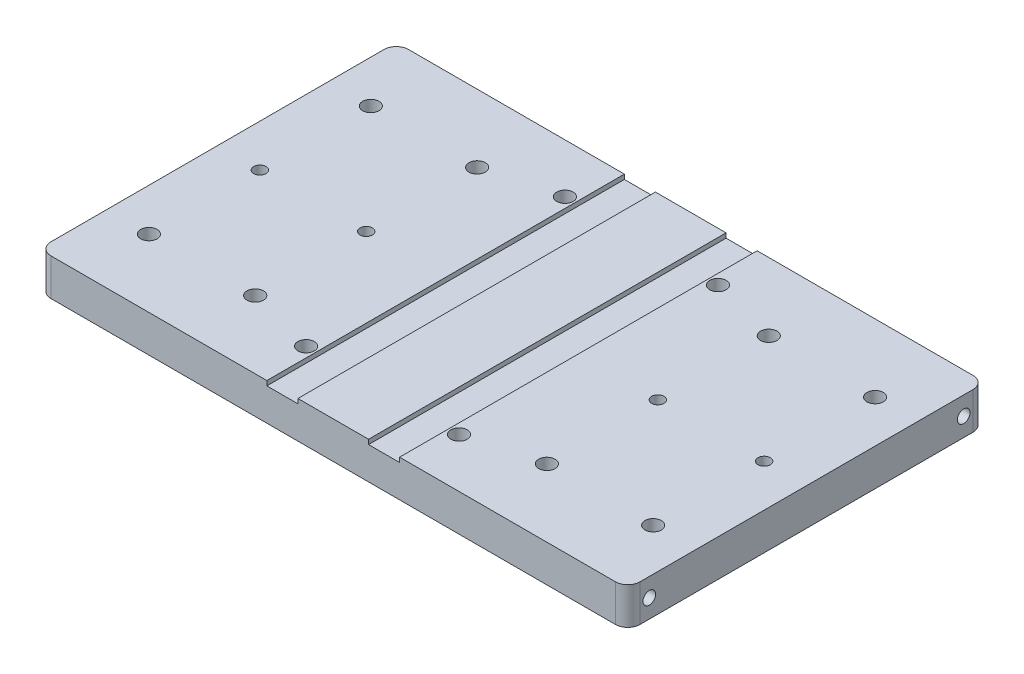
from build123d import *

# Parameters (mm, degrees)
SKETCH1_W                                         = 303.3776
SKETCH1_H                                         = 184.15
BOSS_EXTRUDE1_DEPTH                               = 9.525
SKETCH2_W                                         = 16.002
SKETCH2_H                                         = 2.38600742
CUT_EXTRUDE1_DEPTH                                = 239.770685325
CBORE_FOR_5_16_SOCKET_HEAD_CAP_SCREW1_D           = 8.4328
CBORE_FOR_5_16_SOCKET_HEAD_CAP_SCREW1_CBORE_D     = 13.49502
CBORE_FOR_5_16_SOCKET_HEAD_CAP_SCREW1_CBORE_DEPTH = 7.9375
F_5_16_18_TAPPED_HOLE1_AT_2_COUNT                 = 2
F_5_16_18_TAPPED_HOLE1_AT_2_PITCH                 = 161.925
CBORE_FOR_5_16_SOCKET_HEAD_CAP_SCREW2_D           = 8.4328
CBORE_FOR_5_16_SOCKET_HEAD_CAP_SCREW2_CBORE_D     = 13.49502
CBORE_FOR_5_16_SOCKET_HEAD_CAP_SCREW2_CBORE_DEPTH = 7.9375
F_1_4_0_2500_DOWEL_HOLE1_D                        = 6.35
FILLET1_R                                         = 6.35


with BuildPart() as part:
    # Sketch1 → Boss-Extrude1 (new, symmetric)
    with BuildSketch(Plane(origin=(0, 0, 0), x_dir=(1, 0, 0), z_dir=(0, 1, 0))):
        Rectangle(SKETCH1_W, SKETCH1_H)
    extrude(amount=BOSS_EXTRUDE1_DEPTH, both=True)

    # Sketch2 → Cut-Extrude1 (cut, through all)
    with BuildSketch(Plane(origin=(0, 0, -92.075), x_dir=(-1, 0, 0), z_dir=(0, 0, -1))):
        with Locations((-26.1874, 8.33199629)):
            Rectangle(SKETCH2_W, SKETCH2_H)
        with Locations((26.1874, 8.33199629)):
            Rectangle(SKETCH2_W, SKETCH2_H)
    extrude(amount=-CUT_EXTRUDE1_DEPTH, mode=Mode.SUBTRACT)

    # CBORE for 5_16 Socket Head Cap Screw1 (through all)
    with Locations(Plane(origin=(0, -9.525, 0), x_dir=(-1, 0, 0), z_dir=(0, -1, 0))):
        with Locations((39.395400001, 66.675), (39.395400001, -66.675), (-39.395400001, -66.675), (-39.395400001, 66.675)):
            CounterBoreHole(CBORE_FOR_5_16_SOCKET_HEAD_CAP_SCREW1_D / 2, CBORE_FOR_5_16_SOCKET_HEAD_CAP_SCREW1_CBORE_D / 2, CBORE_FOR_5_16_SOCKET_HEAD_CAP_SCREW1_CBORE_DEPTH)

    # Sketch6 → 5_16-18 Tapped Hole1 (revolve, cut)
    with BuildSketch(Plane(origin=(151.6888, 0, 80.9625), x_dir=(0, 0, -1), z_dir=(0, 1, 0))):
        Polygon((0, 0), (0, 22.281148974), (3.2639, 20.32), (3.2639, 0), align=None)
    f_5_16_18_tapped_hole1 = revolve(axis=Axis((158.0388, 0, 80.9625), (-1, 0, 0)), mode=Mode.SUBTRACT)

    # 5_16-18 Tapped Hole1 at 2: 5_16-18 Tapped Hole1 ×2
    with Locations(*[(0, 0, -i * F_5_16_18_TAPPED_HOLE1_AT_2_PITCH) for i in range(1, F_5_16_18_TAPPED_HOLE1_AT_2_COUNT)]):
        add(f_5_16_18_tapped_hole1, mode=Mode.SUBTRACT)

    # CBORE for 5_16 Socket Head Cap Screw2 (through all)
    with Locations(Plane(origin=(0, -9.525, 0), x_dir=(-1, 0, 0), z_dir=(0, -1, 0))):
        with Locations((75.107800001, 57.15), (75.107800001, -57.15), (129.870200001, -57.15), (129.870200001, 57.15), (-129.8702, -57.15), (-129.8702, 57.15), (-75.1078, -57.15), (-75.1078, 57.15)):
            CounterBoreHole(CBORE_FOR_5_16_SOCKET_HEAD_CAP_SCREW2_D / 2, CBORE_FOR_5_16_SOCKET_HEAD_CAP_SCREW2_CBORE_D / 2, CBORE_FOR_5_16_SOCKET_HEAD_CAP_SCREW2_CBORE_DEPTH)

    # 1_4 _0.2500_ Dowel Hole1 (through all)
    with Locations(Plane(origin=(0, 9.525, 0), x_dir=(1, 0, 0), z_dir=(0, 1, 0))):
        with Locations((129.8702, 0), (75.1078, 0), (-129.870200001, 0), (-75.107800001, 0)):
            Hole(F_1_4_0_2500_DOWEL_HOLE1_D / 2)

    # Mirror1: 5_16-18 Tapped Hole1 across plane
    add(f_5_16_18_tapped_hole1.mirror(Plane(origin=(0, 0, 0), x_dir=(0, 0, 1), z_dir=(1, 0, 0))), mode=Mode.SUBTRACT)

    # Mirror1 copy 1 sketch → Mirror1 copy 1 (revolve, cut)
    with BuildSketch(Plane(origin=(-151.6888, 0, -80.9625), x_dir=(0, 0, -1), z_dir=(0, 1, 0))):
        Polygon((0, 0), (0, -22.281148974), (3.2639, -20.32), (3.2639, 0), align=None)
    revolve(axis=Axis((-158.0388, 0, -80.9625), (-1, 0, 0)), mode=Mode.SUBTRACT)

    # Fillet1
    fillet1_edges = [part.edges().sort_by_distance(p)[0] for p in [
        (151.6888, 0, 92.075),
        (-151.6888, 0, 92.075),
        (-151.6888, 0, -92.075),
        (151.6888, 0, -92.075),
    ]]
    fillet(fillet1_edges, radius=FILLET1_R)


solid = part.part
